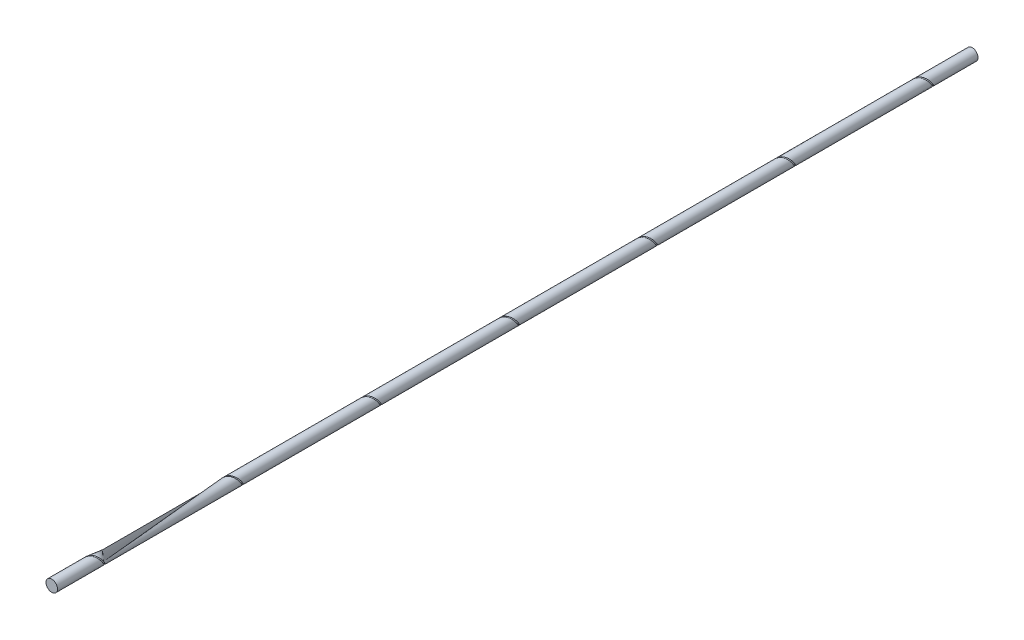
from build123d import *

# Parameters (mm, degrees)
SKETCH1_R              = 25
BOSS_EXTRUDE1_DEPTH    = 4000
CUT_SWEEP1_PITCH       = 100
CUT_SWEEP1_HEIGHT      = 100
CUT_SWEEP1_RADIUS      = 27.646
CUT_SWEEP1_START_ANGLE = -180
SKETCH3_R              = 3.969
LPATTERN1_COUNT        = 7
LPATTERN1_PITCH        = 600


with BuildPart() as part:
    # Sketch1 → Boss-Extrude1 (new body)
    with BuildSketch(Plane.XY):
        Circle(SKETCH1_R)
    extrude(amount=BOSS_EXTRUDE1_DEPTH)

    # Cut-Sweep1: sweep along a helix
    with BuildLine() as cut_sweep1_path:
        add(Helix(CUT_SWEEP1_PITCH, CUT_SWEEP1_HEIGHT, CUT_SWEEP1_RADIUS, center=(0, 0, 150), direction=(0, 0, 1), mode=Mode.PRIVATE).rotate(Axis((0, 0, 150), (0, 0, 1)), CUT_SWEEP1_START_ANGLE))
    # Sketch3 → Cut-Sweep1 (sweep, cut)
    with BuildSketch(Plane(origin=(0, 0, 0), x_dir=(1, 0, 0), z_dir=(0, 1, 0))):
        with Locations((-27.646, -150)):
            Circle(SKETCH3_R)
    cut_sweep1 = sweep(path=cut_sweep1_path.line, is_frenet=True, mode=Mode.SUBTRACT)

    # LPattern1: Cut-Sweep1 ×7
    with Locations(*[(0, 0, i * LPATTERN1_PITCH) for i in range(1, LPATTERN1_COUNT)]):
        add(cut_sweep1, mode=Mode.SUBTRACT)


solid = part.part
